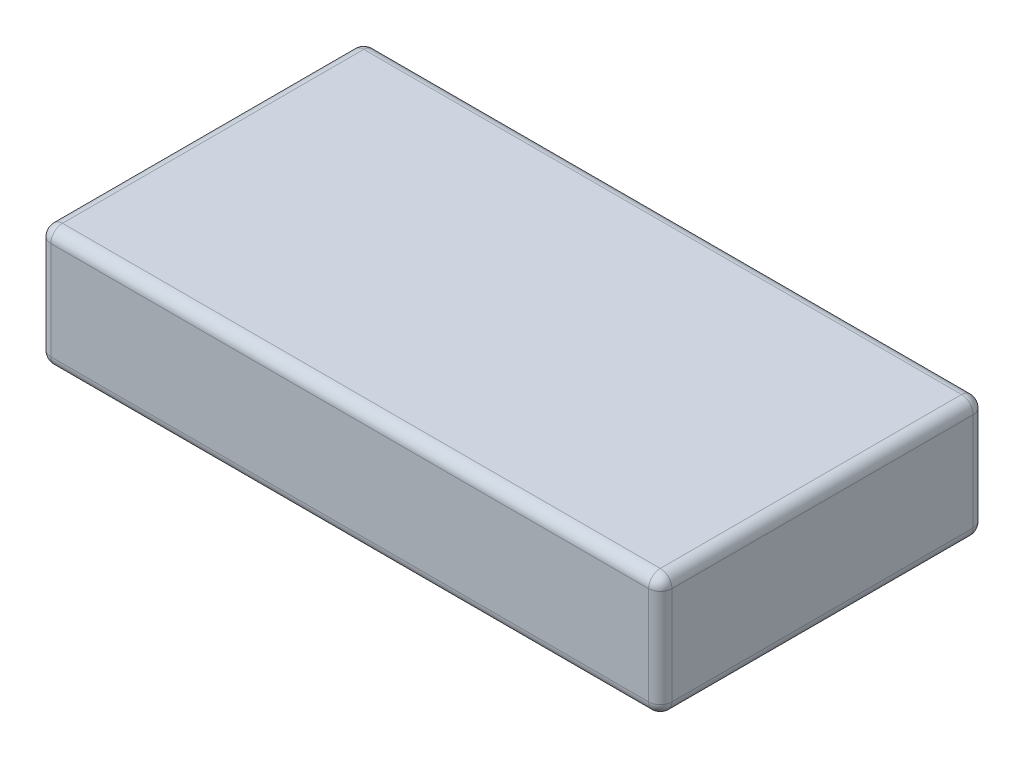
from build123d import *

# Parameters (mm, degrees)
SKETCH_1_W      = 53.2
SKETCH_1_H      = 27.8
EXTRUDE_1_DEPTH = 10.4
FILLET_1_R      = 1


with BuildPart() as part:
    # Sketch 1 → Extrude 1 (new body)
    with BuildSketch(Plane(origin=(0, 0, 0), x_dir=(1, 0, 0), z_dir=(0, 1, 0))):
        Rectangle(SKETCH_1_W, SKETCH_1_H)
    extrude(amount=EXTRUDE_1_DEPTH)

    # Fillet 1
    fillet_1_edges = [part.edges().sort_by_distance(p)[0] for p in [
        (-26.6, 10.4, 0),
        (0, 10.4, 13.9),
        (26.6, 10.4, 0),
        (0, 0, 13.9),
        (-26.6, 0, 0),
        (0, 0, -13.9),
        (26.6, 0, 0),
        (26.6, 5.2, 13.9),
        (-26.6, 5.2, 13.9),
        (-26.6, 5.2, -13.9),
        (26.6, 5.2, -13.9),
        (0, 10.4, -13.9),
    ]]
    fillet(fillet_1_edges, radius=FILLET_1_R)


solid = part.part
